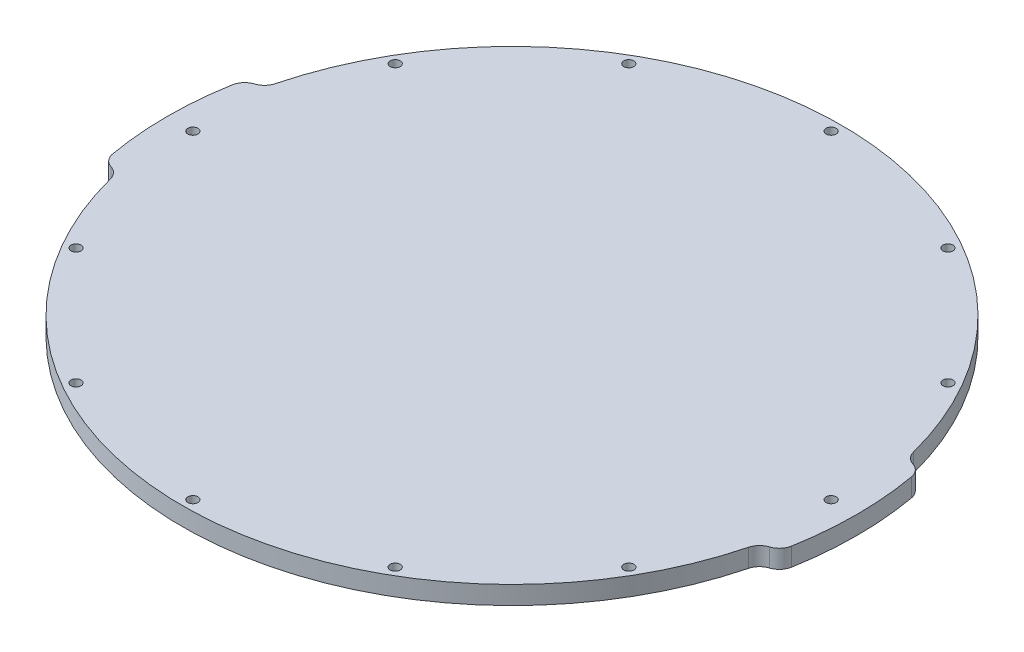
from build123d import *

# Parameters (mm, degrees)
SKETCH1_R           = 1.65
BOSS_EXTRUDE1_DEPTH = 6
FILLET1_R           = 5


with BuildPart() as part:
    # Sketch1 → Boss-Extrude1 (new body)
    with BuildSketch(Plane(origin=(0, 0, 0), x_dir=(1, 0, 0), z_dir=(0, 1, 0))):
        with BuildLine():
            ThreePointArc((-111.234035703, -19.613561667), (-112.95, 0), (-111.234035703, 19.613561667))
            ThreePointArc((-111.234035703, 19.613561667), (-109.13025705, 22.87401705), (-105.327953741, 23.647931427))
            ThreePointArc((-105.327953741, 23.647931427), (0, 107.95), (105.327953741, 23.647931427))
            ThreePointArc((105.327953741, 23.647931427), (109.13025705, 22.87401705), (111.234035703, 19.613561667))
            ThreePointArc((111.234035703, 19.613561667), (112.95, 0), (111.234035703, -19.613561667))
            ThreePointArc((111.234035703, -19.613561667), (109.13025705, -22.87401705), (105.327953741, -23.647931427))
            ThreePointArc((105.327953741, -23.647931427), (0, -107.95), (-105.327953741, -23.647931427))
            ThreePointArc((-105.327953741, -23.647931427), (-109.13025705, -22.87401705), (-111.234035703, -19.613561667))
        make_face()
        with Locations(Location((0, 104.55, 0), (0, 0, 270))):
            Circle(SKETCH1_R, mode=Mode.SUBTRACT)
        with Locations(Location((52.275, 90.542955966, 0), (0, 0, 270))):
            Circle(SKETCH1_R, mode=Mode.SUBTRACT)
        with Locations(Location((90.542955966, 52.275, 0), (0, 0, 270))):
            Circle(SKETCH1_R, mode=Mode.SUBTRACT)
        with Locations(Location((104.55, 0, 0), (0, 0, 270))):
            Circle(SKETCH1_R, mode=Mode.SUBTRACT)
        with Locations(Location((90.542955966, -52.275, 0), (0, 0, 270))):
            Circle(SKETCH1_R, mode=Mode.SUBTRACT)
        with Locations(Location((52.275, -90.542955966, 0), (0, 0, 270))):
            Circle(SKETCH1_R, mode=Mode.SUBTRACT)
        with Locations(Location((0, -104.55, 0), (0, 0, 270))):
            Circle(SKETCH1_R, mode=Mode.SUBTRACT)
        with Locations(Location((-52.275, -90.542955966, 0), (0, 0, 270))):
            Circle(SKETCH1_R, mode=Mode.SUBTRACT)
        with Locations(Location((-90.542955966, -52.275, 0), (0, 0, 270))):
            Circle(SKETCH1_R, mode=Mode.SUBTRACT)
        with Locations(Location((-104.55, 0, 0), (0, 0, 270))):
            Circle(SKETCH1_R, mode=Mode.SUBTRACT)
        with Locations(Location((-90.542955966, 52.275, 0), (0, 0, 270))):
            Circle(SKETCH1_R, mode=Mode.SUBTRACT)
        with Locations(Location((-52.275, 90.542955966, 0), (0, 0, 270))):
            Circle(SKETCH1_R, mode=Mode.SUBTRACT)
    extrude(amount=BOSS_EXTRUDE1_DEPTH)

    # Fillet1
    fillet1_edges = [part.edges().sort_by_distance(p)[0] for p in [
        (-105.327953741, 3, -23.647931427),
        (105.327953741, 3, -23.647931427),
        (105.327953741, 3, 23.647931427),
        (-105.327953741, 3, 23.647931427),
    ]]
    fillet(fillet1_edges, radius=FILLET1_R)


solid = part.part
